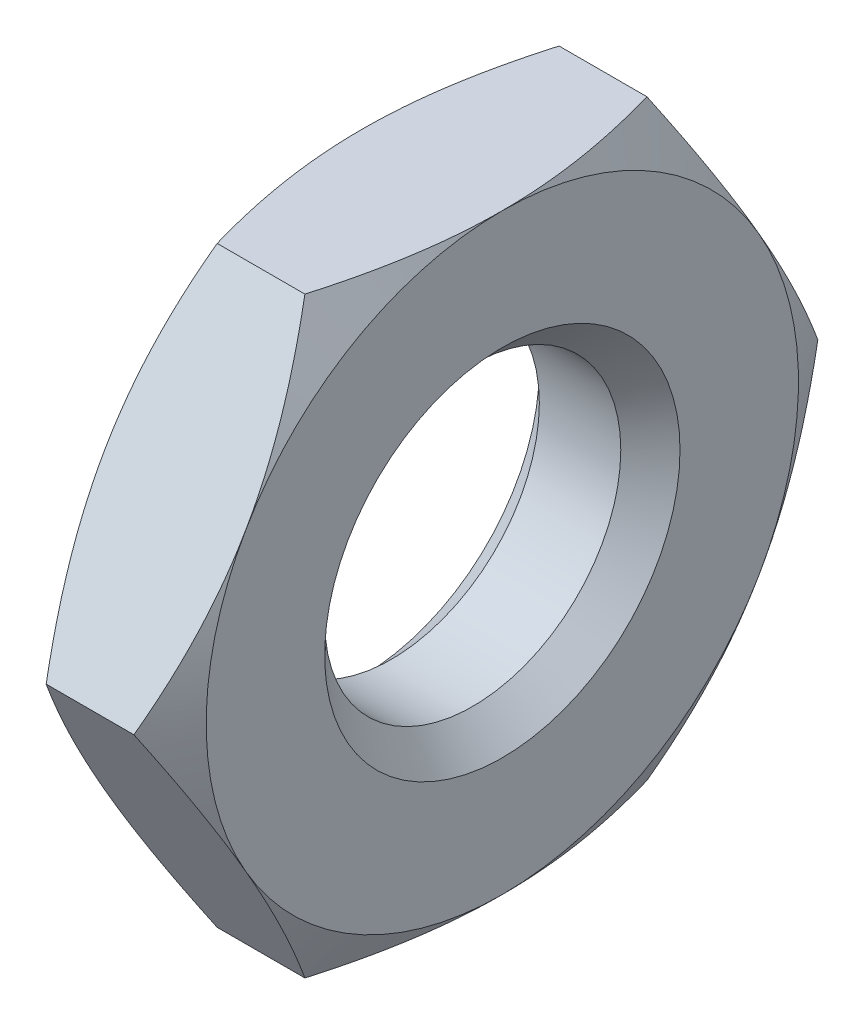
from build123d import *

# Parameters (mm, degrees)
SKETCH1_R      = 1
EXTRUDE1_DEPTH = 0.95
CHAMFER1_SIZE  = 0.2


with BuildPart() as part:
    # Sketch1 → Extrude1 (new body)
    with BuildSketch(Plane(origin=(0, 0, 0), x_dir=(0, 0, -1), z_dir=(1, 0, 0))):
        Polygon((1.154700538, 2), (-1.154700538, 2), (-2.309401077, 0), (-1.154700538, -2), (1.154700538, -2), (2.309401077, 0), align=None)
        with Locations(Location((0, 0, 0), (0, 0, 180))):
            Circle(SKETCH1_R, mode=Mode.SUBTRACT)
    extrude(amount=EXTRUDE1_DEPTH)

    # Sketch2 → Cut-Revolve1 (revolve, cut)
    with BuildSketch(Plane.XY):
        Polygon((0.95, 2), (0.95, 8), (0, 8), (0, 2), (0.475, 2.822724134), align=None)
    revolve(axis=Axis((0.95, 0, 0), (-1, 0, 0)), mode=Mode.SUBTRACT)

    # Chamfer1
    chamfer1_edges = [part.edges().sort_by_distance(p)[0] for p in [
        (0, 0, -1),
        (0.95, 0, -1),
    ]]
    chamfer(chamfer1_edges, length=CHAMFER1_SIZE)


solid = part.part
